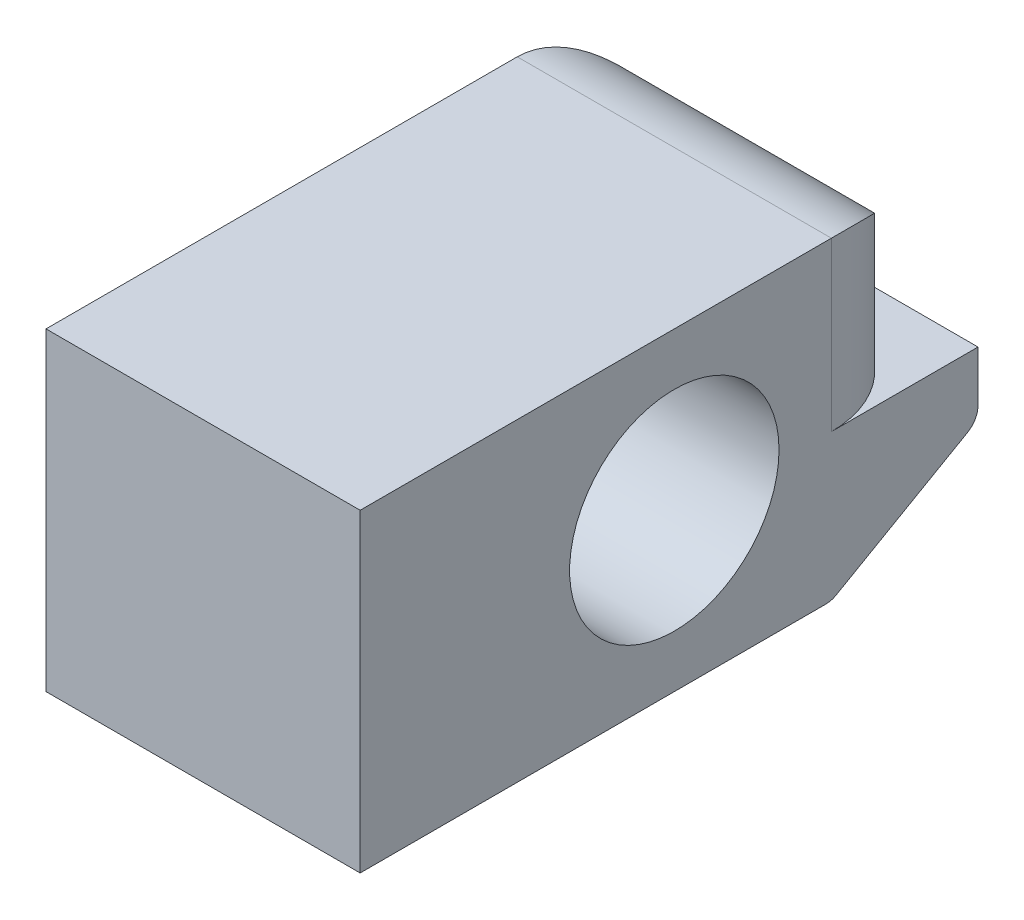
ISO-10303-21;
HEADER;
FILE_DESCRIPTION(('STEP AP214'),'2;1');
FILE_NAME('part.step','',(''),(''),'','','');
FILE_SCHEMA(('AUTOMOTIVE_DESIGN { 1 0 10303 214 1 1 1 1 }'));
ENDSEC;
DATA;
#1=APPLICATION_CONTEXT('core data for automotive mechanical design processes');
#2=APPLICATION_PROTOCOL_DEFINITION('international standard','automotive_design',2000,#1);
#3=PRODUCT_CONTEXT('',#1,'mechanical');
#4=PRODUCT('Part','Part','',(#3));
#5=PRODUCT_RELATED_PRODUCT_CATEGORY('part','',(#4));
#6=PRODUCT_DEFINITION_FORMATION('','',#4);
#7=PRODUCT_DEFINITION_CONTEXT('part definition',#1,'design');
#8=PRODUCT_DEFINITION('design','',#6,#7);
#9=PRODUCT_DEFINITION_SHAPE('','',#8);
#10=(LENGTH_UNIT() NAMED_UNIT(*) SI_UNIT(.MILLI.,.METRE.));
#11=(NAMED_UNIT(*) PLANE_ANGLE_UNIT() SI_UNIT($,.RADIAN.));
#12=(NAMED_UNIT(*) SI_UNIT($,.STERADIAN.) SOLID_ANGLE_UNIT());
#13=UNCERTAINTY_MEASURE_WITH_UNIT(LENGTH_MEASURE(1.E-05),#10,'distance_accuracy_value','');
#14=(GEOMETRIC_REPRESENTATION_CONTEXT(3) GLOBAL_UNCERTAINTY_ASSIGNED_CONTEXT((#13)) GLOBAL_UNIT_ASSIGNED_CONTEXT((#10,
#11,#12)) REPRESENTATION_CONTEXT('',''));
#15=CARTESIAN_POINT('',(0.,0.,0.));
#16=DIRECTION('',(0.,0.,1.));
#17=DIRECTION('',(1.,0.,0.));
#18=AXIS2_PLACEMENT_3D('',#15,#16,#17);
#19=CARTESIAN_POINT('',(3.,3.,0.));
#20=DIRECTION('',(0.,0.,-1.));
#21=DIRECTION('',(-1.,0.,0.));
#22=AXIS2_PLACEMENT_3D('',#19,#20,#21);
#23=PLANE('',#22);
#24=DIRECTION('',(1.,0.,0.));
#25=VECTOR('',#24,1.);
#26=CARTESIAN_POINT('',(3.,0.,0.));
#27=LINE('',#26,#25);
#28=CARTESIAN_POINT('',(0.,0.,0.));
#29=VERTEX_POINT('',#28);
#30=CARTESIAN_POINT('',(3.,0.,0.));
#31=VERTEX_POINT('',#30);
#32=EDGE_CURVE('E172',#29,#31,#27,.T.);
#33=ORIENTED_EDGE('',*,*,#32,.T.);
#34=DIRECTION('',(0.,-1.,0.));
#35=VECTOR('',#34,1.);
#36=CARTESIAN_POINT('',(3.,3.,0.));
#37=LINE('',#36,#35);
#38=CARTESIAN_POINT('',(3.,3.,0.));
#39=VERTEX_POINT('',#38);
#40=EDGE_CURVE('E183',#39,#31,#37,.T.);
#41=ORIENTED_EDGE('',*,*,#40,.F.);
#42=DIRECTION('',(1.,0.,0.));
#43=VECTOR('',#42,1.);
#44=CARTESIAN_POINT('',(3.,3.,0.));
#45=LINE('',#44,#43);
#46=CARTESIAN_POINT('',(0.,3.,0.));
#47=VERTEX_POINT('',#46);
#48=EDGE_CURVE('E165',#47,#39,#45,.T.);
#49=ORIENTED_EDGE('',*,*,#48,.F.);
#50=DIRECTION('',(0.,-1.,0.));
#51=VECTOR('',#50,1.);
#52=CARTESIAN_POINT('',(0.,3.,0.));
#53=LINE('',#52,#51);
#54=EDGE_CURVE('E173',#47,#29,#53,.T.);
#55=ORIENTED_EDGE('',*,*,#54,.T.);
#56=EDGE_LOOP('',(#33,#41,#49,#55));
#57=FACE_BOUND('',#56,.T.);
#58=ADVANCED_FACE('F40',(#57),#23,.F.);
#59=CARTESIAN_POINT('',(3.,3.,-5.5));
#60=DIRECTION('',(-1.,0.,0.));
#61=DIRECTION('',(0.,0.,1.));
#62=AXIS2_PLACEMENT_3D('',#59,#60,#61);
#63=PLANE('',#62);
#64=DIRECTION('',(0.,0.496138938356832,-0.86824314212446));
#65=VECTOR('',#64,1.);
#66=CARTESIAN_POINT('',(3.,0.8,-5.90000000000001));
#67=LINE('',#66,#65);
#68=CARTESIAN_POINT('',(3.,0.0263513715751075,-4.54611490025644));
#69=VERTEX_POINT('',#68);
#70=CARTESIAN_POINT('',(3.,0.742415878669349,-5.79922778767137));
#71=VERTEX_POINT('',#70);
#72=EDGE_CURVE('E215',#69,#71,#67,.T.);
#73=ORIENTED_EDGE('',*,*,#72,.T.);
#74=CARTESIAN_POINT('',(3.,0.916064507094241,-5.7));
#75=DIRECTION('',(-1.,0.,0.));
#76=DIRECTION('',(0.,0.,1.));
#77=AXIS2_PLACEMENT_3D('',#74,#75,#76);
#78=CIRCLE('',#77,0.2);
#79=CARTESIAN_POINT('',(3.,0.916064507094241,-5.9));
#80=VERTEX_POINT('',#79);
#81=EDGE_CURVE('E44',#71,#80,#78,.F.);
#82=ORIENTED_EDGE('',*,*,#81,.T.);
#83=DIRECTION('',(0.,-1.,0.));
#84=VECTOR('',#83,1.);
#85=CARTESIAN_POINT('',(3.,1.4,-5.9));
#86=LINE('',#85,#84);
#87=CARTESIAN_POINT('',(3.,1.4,-5.9));
#88=VERTEX_POINT('',#87);
#89=EDGE_CURVE('E147',#88,#80,#86,.T.);
#90=ORIENTED_EDGE('',*,*,#89,.F.);
#91=DIRECTION('',(0.,0.,-1.));
#92=VECTOR('',#91,1.);
#93=CARTESIAN_POINT('',(2.99999999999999,1.4,0.00200000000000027));
#94=LINE('',#93,#92);
#95=CARTESIAN_POINT('',(3.,1.4,-4.5));
#96=VERTEX_POINT('',#95);
#97=EDGE_CURVE('E139',#96,#88,#94,.T.);
#98=ORIENTED_EDGE('',*,*,#97,.F.);
#99=DIRECTION('',(0.,-1.,0.));
#100=VECTOR('',#99,1.);
#101=CARTESIAN_POINT('',(3.,3.,-4.5));
#102=LINE('',#101,#100);
#103=CARTESIAN_POINT('',(3.,3.,-4.5));
#104=VERTEX_POINT('',#103);
#105=EDGE_CURVE('E122',#96,#104,#102,.F.);
#106=ORIENTED_EDGE('',*,*,#105,.T.);
#107=DIRECTION('',(0.,0.,-1.));
#108=VECTOR('',#107,1.);
#109=CARTESIAN_POINT('',(3.,3.,-5.5));
#110=LINE('',#109,#108);
#111=EDGE_CURVE('E170',#39,#104,#110,.T.);
#112=ORIENTED_EDGE('',*,*,#111,.F.);
#113=ORIENTED_EDGE('',*,*,#40,.T.);
#114=DIRECTION('',(0.,0.,-1.));
#115=VECTOR('',#114,1.);
#116=CARTESIAN_POINT('',(3.,0.,-5.5));
#117=LINE('',#116,#115);
#118=CARTESIAN_POINT('',(3.,0.,-4.44688711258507));
#119=VERTEX_POINT('',#118);
#120=EDGE_CURVE('E180',#31,#119,#117,.T.);
#121=ORIENTED_EDGE('',*,*,#120,.T.);
#122=CARTESIAN_POINT('',(3.,0.2,-4.44688711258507));
#123=DIRECTION('',(-1.,0.,0.));
#124=DIRECTION('',(0.,0.,1.));
#125=AXIS2_PLACEMENT_3D('',#122,#123,#124);
#126=CIRCLE('',#125,0.2);
#127=EDGE_CURVE('E55',#119,#69,#126,.F.);
#128=ORIENTED_EDGE('',*,*,#127,.T.);
#129=EDGE_LOOP('',(#73,#82,#90,#98,#106,#112,#113,#121,#128));
#130=FACE_BOUND('',#129,.T.);
#131=CARTESIAN_POINT('',(3.,1.5,-3.));
#132=DIRECTION('',(1.,0.,0.));
#133=DIRECTION('',(0.,0.,-1.));
#134=AXIS2_PLACEMENT_3D('',#131,#132,#133);
#135=CIRCLE('',#134,1.);
#136=CARTESIAN_POINT('',(3.,1.5,-4.));
#137=VERTEX_POINT('',#136);
#138=EDGE_CURVE('E159',#137,#137,#135,.T.);
#139=ORIENTED_EDGE('',*,*,#138,.F.);
#140=EDGE_LOOP('',(#139));
#141=FACE_BOUND('',#140,.T.);
#142=ADVANCED_FACE('F150',(#130,#141),#63,.F.);
#143=CARTESIAN_POINT('',(0.,3.,-5.50000000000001));
#144=DIRECTION('',(0.,0.,1.));
#145=DIRECTION('',(1.,0.,0.));
#146=AXIS2_PLACEMENT_3D('',#143,#144,#145);
#147=PLANE('',#146);
#148=DIRECTION('',(0.,-1.,0.));
#149=VECTOR('',#148,1.);
#150=CARTESIAN_POINT('',(2.,3.,-5.5));
#151=LINE('',#150,#149);
#152=CARTESIAN_POINT('',(2.,2.,-5.5));
#153=VERTEX_POINT('',#152);
#154=CARTESIAN_POINT('',(2.,1.4,-5.5));
#155=VERTEX_POINT('',#154);
#156=EDGE_CURVE('E134',#153,#155,#151,.T.);
#157=ORIENTED_EDGE('',*,*,#156,.T.);
#158=DIRECTION('',(1.,0.,0.));
#159=VECTOR('',#158,1.);
#160=CARTESIAN_POINT('',(0.,1.4,-5.50000000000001));
#161=LINE('',#160,#159);
#162=CARTESIAN_POINT('',(1.,1.4,-5.5));
#163=VERTEX_POINT('',#162);
#164=EDGE_CURVE('E145',#163,#155,#161,.T.);
#165=ORIENTED_EDGE('',*,*,#164,.F.);
#166=DIRECTION('',(0.,-1.,0.));
#167=VECTOR('',#166,1.);
#168=CARTESIAN_POINT('',(1.,3.,-5.5));
#169=LINE('',#168,#167);
#170=CARTESIAN_POINT('',(1.,2.,-5.5));
#171=VERTEX_POINT('',#170);
#172=EDGE_CURVE('E190',#163,#171,#169,.F.);
#173=ORIENTED_EDGE('',*,*,#172,.T.);
#174=DIRECTION('',(-1.,0.,0.));
#175=VECTOR('',#174,1.);
#176=CARTESIAN_POINT('',(0.,2.,-5.50000000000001));
#177=LINE('',#176,#175);
#178=EDGE_CURVE('E186',#171,#153,#177,.F.);
#179=ORIENTED_EDGE('',*,*,#178,.T.);
#180=EDGE_LOOP('',(#157,#165,#173,#179));
#181=FACE_BOUND('',#180,.T.);
#182=ADVANCED_FACE('F246',(#181),#147,.F.);
#183=CARTESIAN_POINT('',(0.,3.,0.));
#184=DIRECTION('',(1.,0.,0.));
#185=DIRECTION('',(0.,0.,-1.));
#186=AXIS2_PLACEMENT_3D('',#183,#184,#185);
#187=PLANE('',#186);
#188=DIRECTION('',(0.,1.,0.));
#189=VECTOR('',#188,1.);
#190=CARTESIAN_POINT('',(0.,0.8,-5.9));
#191=LINE('',#190,#189);
#192=CARTESIAN_POINT('',(0.,0.916064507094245,-5.9));
#193=VERTEX_POINT('',#192);
#194=CARTESIAN_POINT('',(0.,1.4,-5.9));
#195=VERTEX_POINT('',#194);
#196=EDGE_CURVE('E153',#193,#195,#191,.T.);
#197=ORIENTED_EDGE('',*,*,#196,.F.);
#198=CARTESIAN_POINT('',(0.,0.916064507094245,-5.70000000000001));
#199=DIRECTION('',(1.,0.,0.));
#200=DIRECTION('',(0.,0.,-1.));
#201=AXIS2_PLACEMENT_3D('',#198,#199,#200);
#202=CIRCLE('',#201,0.2);
#203=CARTESIAN_POINT('',(0.,0.742415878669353,-5.79922778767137));
#204=VERTEX_POINT('',#203);
#205=EDGE_CURVE('E207',#193,#204,#202,.F.);
#206=ORIENTED_EDGE('',*,*,#205,.T.);
#207=DIRECTION('',(0.,-0.496138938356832,0.86824314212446));
#208=VECTOR('',#207,1.);
#209=CARTESIAN_POINT('',(0.,0.8,-5.9));
#210=LINE('',#209,#208);
#211=CARTESIAN_POINT('',(0.,0.0263513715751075,-4.54611490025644));
#212=VERTEX_POINT('',#211);
#213=EDGE_CURVE('E144',#204,#212,#210,.T.);
#214=ORIENTED_EDGE('',*,*,#213,.T.);
#215=CARTESIAN_POINT('',(0.,0.2,-4.44688711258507));
#216=DIRECTION('',(1.,0.,0.));
#217=DIRECTION('',(0.,0.,-1.));
#218=AXIS2_PLACEMENT_3D('',#215,#216,#217);
#219=CIRCLE('',#218,0.2);
#220=CARTESIAN_POINT('',(0.,0.,-4.44688711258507));
#221=VERTEX_POINT('',#220);
#222=EDGE_CURVE('E203',#212,#221,#219,.F.);
#223=ORIENTED_EDGE('',*,*,#222,.T.);
#224=DIRECTION('',(0.,0.,1.));
#225=VECTOR('',#224,1.);
#226=CARTESIAN_POINT('',(0.,0.,0.));
#227=LINE('',#226,#225);
#228=EDGE_CURVE('E166',#221,#29,#227,.T.);
#229=ORIENTED_EDGE('',*,*,#228,.T.);
#230=ORIENTED_EDGE('',*,*,#54,.F.);
#231=DIRECTION('',(0.,0.,1.));
#232=VECTOR('',#231,1.);
#233=CARTESIAN_POINT('',(0.,3.,0.));
#234=LINE('',#233,#232);
#235=CARTESIAN_POINT('',(0.,3.,-4.5));
#236=VERTEX_POINT('',#235);
#237=EDGE_CURVE('E171',#236,#47,#234,.T.);
#238=ORIENTED_EDGE('',*,*,#237,.F.);
#239=DIRECTION('',(0.,-1.,0.));
#240=VECTOR('',#239,1.);
#241=CARTESIAN_POINT('',(0.,3.,-4.5));
#242=LINE('',#241,#240);
#243=CARTESIAN_POINT('',(0.,1.4,-4.5));
#244=VERTEX_POINT('',#243);
#245=EDGE_CURVE('E191',#236,#244,#242,.T.);
#246=ORIENTED_EDGE('',*,*,#245,.T.);
#247=DIRECTION('',(0.,0.,-1.));
#248=VECTOR('',#247,1.);
#249=CARTESIAN_POINT('',(0.,1.4,0.00199999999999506));
#250=LINE('',#249,#248);
#251=EDGE_CURVE('E152',#244,#195,#250,.T.);
#252=ORIENTED_EDGE('',*,*,#251,.T.);
#253=EDGE_LOOP('',(#197,#206,#214,#223,#229,#230,#238,#246,#252));
#254=FACE_BOUND('',#253,.T.);
#255=CARTESIAN_POINT('',(0.,1.5,-3.));
#256=DIRECTION('',(1.,0.,0.));
#257=DIRECTION('',(0.,0.,-1.));
#258=AXIS2_PLACEMENT_3D('',#255,#256,#257);
#259=CIRCLE('',#258,1.);
#260=CARTESIAN_POINT('',(0.,1.5,-4.));
#261=VERTEX_POINT('',#260);
#262=EDGE_CURVE('E161',#261,#261,#259,.T.);
#263=ORIENTED_EDGE('',*,*,#262,.T.);
#264=EDGE_LOOP('',(#263));
#265=FACE_BOUND('',#264,.T.);
#266=ADVANCED_FACE('F225',(#254,#265),#187,.F.);
#267=CARTESIAN_POINT('',(0.,3.,0.));
#268=DIRECTION('',(0.,-1.,0.));
#269=DIRECTION('',(0.,0.,-1.));
#270=AXIS2_PLACEMENT_3D('',#267,#268,#269);
#271=PLANE('',#270);
#272=ORIENTED_EDGE('',*,*,#111,.T.);
#273=DIRECTION('',(-1.,0.,0.));
#274=VECTOR('',#273,1.);
#275=CARTESIAN_POINT('',(0.,3.,-4.5));
#276=LINE('',#275,#274);
#277=EDGE_CURVE('E132',#104,#236,#276,.T.);
#278=ORIENTED_EDGE('',*,*,#277,.T.);
#279=ORIENTED_EDGE('',*,*,#237,.T.);
#280=ORIENTED_EDGE('',*,*,#48,.T.);
#281=EDGE_LOOP('',(#272,#278,#279,#280));
#282=FACE_BOUND('',#281,.T.);
#283=ADVANCED_FACE('F239',(#282),#271,.F.);
#284=CARTESIAN_POINT('',(0.,0.,0.));
#285=DIRECTION('',(0.,-1.,0.));
#286=DIRECTION('',(0.,0.,-1.));
#287=AXIS2_PLACEMENT_3D('',#284,#285,#286);
#288=PLANE('',#287);
#289=ORIENTED_EDGE('',*,*,#228,.F.);
#290=DIRECTION('',(1.,0.,0.));
#291=VECTOR('',#290,1.);
#292=CARTESIAN_POINT('',(0.,0.,-4.44688711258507));
#293=LINE('',#292,#291);
#294=EDGE_CURVE('E11',#221,#119,#293,.T.);
#295=ORIENTED_EDGE('',*,*,#294,.T.);
#296=ORIENTED_EDGE('',*,*,#120,.F.);
#297=ORIENTED_EDGE('',*,*,#32,.F.);
#298=EDGE_LOOP('',(#289,#295,#296,#297));
#299=FACE_BOUND('',#298,.T.);
#300=ADVANCED_FACE('F268',(#299),#288,.T.);
#301=CARTESIAN_POINT('',(1.,3.,-4.5));
#302=DIRECTION('',(0.,-1.,0.));
#303=DIRECTION('',(0.,0.,-1.));
#304=AXIS2_PLACEMENT_3D('',#301,#302,#303);
#305=CYLINDRICAL_SURFACE('',#304,1.);
#306=CARTESIAN_POINT('',(1.,1.4,-4.5));
#307=DIRECTION('',(0.,1.,0.));
#308=DIRECTION('',(-1.,0.,0.));
#309=AXIS2_PLACEMENT_3D('',#306,#307,#308);
#310=CIRCLE('',#309,1.);
#311=EDGE_CURVE('E141',#163,#244,#310,.T.);
#312=ORIENTED_EDGE('',*,*,#311,.T.);
#313=ORIENTED_EDGE('',*,*,#245,.F.);
#314=CARTESIAN_POINT('',(1.,2.,-4.5));
#315=DIRECTION('',(-0.707106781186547,-0.707106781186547,0.));
#316=DIRECTION('',(0.707106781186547,-0.707106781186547,0.));
#317=AXIS2_PLACEMENT_3D('',#314,#315,#316);
#318=ELLIPSE('',#317,1.41421356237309,1.);
#319=EDGE_CURVE('E178',#171,#236,#318,.F.);
#320=ORIENTED_EDGE('',*,*,#319,.F.);
#321=ORIENTED_EDGE('',*,*,#172,.F.);
#322=EDGE_LOOP('',(#312,#313,#320,#321));
#323=FACE_BOUND('',#322,.T.);
#324=ADVANCED_FACE('F231',(#323),#305,.T.);
#325=CARTESIAN_POINT('',(0.,2.,-4.5));
#326=DIRECTION('',(-1.,0.,0.));
#327=DIRECTION('',(0.,0.,1.));
#328=AXIS2_PLACEMENT_3D('',#325,#326,#327);
#329=CYLINDRICAL_SURFACE('',#328,1.);
#330=ORIENTED_EDGE('',*,*,#319,.T.);
#331=ORIENTED_EDGE('',*,*,#277,.F.);
#332=CARTESIAN_POINT('',(2.,2.,-4.5));
#333=DIRECTION('',(-0.707106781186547,0.707106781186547,0.));
#334=DIRECTION('',(-0.707106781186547,-0.707106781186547,0.));
#335=AXIS2_PLACEMENT_3D('',#332,#333,#334);
#336=ELLIPSE('',#335,1.41421356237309,1.);
#337=EDGE_CURVE('E126',#153,#104,#336,.F.);
#338=ORIENTED_EDGE('',*,*,#337,.F.);
#339=ORIENTED_EDGE('',*,*,#178,.F.);
#340=EDGE_LOOP('',(#330,#331,#338,#339));
#341=FACE_BOUND('',#340,.T.);
#342=ADVANCED_FACE('F243',(#341),#329,.T.);
#343=CARTESIAN_POINT('',(2.,3.,-4.5));
#344=DIRECTION('',(0.,-1.,0.));
#345=DIRECTION('',(0.,0.,-1.));
#346=AXIS2_PLACEMENT_3D('',#343,#344,#345);
#347=CYLINDRICAL_SURFACE('',#346,1.);
#348=CARTESIAN_POINT('',(2.,1.4,-4.5));
#349=DIRECTION('',(0.,1.,0.));
#350=DIRECTION('',(-1.,0.,0.));
#351=AXIS2_PLACEMENT_3D('',#348,#349,#350);
#352=CIRCLE('',#351,1.);
#353=EDGE_CURVE('E123',#96,#155,#352,.T.);
#354=ORIENTED_EDGE('',*,*,#353,.T.);
#355=ORIENTED_EDGE('',*,*,#156,.F.);
#356=ORIENTED_EDGE('',*,*,#337,.T.);
#357=ORIENTED_EDGE('',*,*,#105,.F.);
#358=EDGE_LOOP('',(#354,#355,#356,#357));
#359=FACE_BOUND('',#358,.T.);
#360=ADVANCED_FACE('F124',(#359),#347,.T.);
#361=CARTESIAN_POINT('',(-1.2E-05,1.5,-3.));
#362=DIRECTION('',(1.,0.,0.));
#363=DIRECTION('',(0.,0.,-1.));
#364=AXIS2_PLACEMENT_3D('',#361,#362,#363);
#365=CYLINDRICAL_SURFACE('',#364,1.);
#366=CARTESIAN_POINT('',(3.,1.5,-4.));
#367=CARTESIAN_POINT('',(2.96875,1.5,-4.));
#368=CARTESIAN_POINT('',(2.9375,1.5,-4.));
#369=CARTESIAN_POINT('',(2.875,1.5,-4.));
#370=CARTESIAN_POINT('',(2.84375,1.5,-4.));
#371=CARTESIAN_POINT('',(2.78125,1.5,-4.));
#372=CARTESIAN_POINT('',(2.75,1.5,-4.));
#373=CARTESIAN_POINT('',(2.6875,1.5,-4.));
#374=CARTESIAN_POINT('',(2.65625,1.5,-4.));
#375=CARTESIAN_POINT('',(2.59375,1.5,-4.));
#376=CARTESIAN_POINT('',(2.5625,1.5,-4.));
#377=CARTESIAN_POINT('',(2.5,1.5,-4.));
#378=CARTESIAN_POINT('',(2.46875,1.5,-4.));
#379=CARTESIAN_POINT('',(2.40625,1.5,-4.));
#380=CARTESIAN_POINT('',(2.375,1.5,-4.));
#381=CARTESIAN_POINT('',(2.3125,1.5,-4.));
#382=CARTESIAN_POINT('',(2.28125,1.5,-4.));
#383=CARTESIAN_POINT('',(2.21875,1.5,-4.));
#384=CARTESIAN_POINT('',(2.1875,1.5,-4.));
#385=CARTESIAN_POINT('',(2.125,1.5,-4.));
#386=CARTESIAN_POINT('',(2.09375,1.5,-4.));
#387=CARTESIAN_POINT('',(2.03125,1.5,-4.));
#388=CARTESIAN_POINT('',(2.,1.5,-4.));
#389=CARTESIAN_POINT('',(1.9375,1.5,-4.));
#390=CARTESIAN_POINT('',(1.90625,1.5,-4.));
#391=CARTESIAN_POINT('',(1.84375,1.5,-4.));
#392=CARTESIAN_POINT('',(1.8125,1.5,-4.));
#393=CARTESIAN_POINT('',(1.75,1.5,-4.));
#394=CARTESIAN_POINT('',(1.71875,1.5,-4.));
#395=CARTESIAN_POINT('',(1.65625,1.5,-4.));
#396=CARTESIAN_POINT('',(1.625,1.5,-4.));
#397=CARTESIAN_POINT('',(1.5625,1.5,-4.));
#398=CARTESIAN_POINT('',(1.53125,1.5,-4.));
#399=CARTESIAN_POINT('',(1.46875,1.5,-4.));
#400=CARTESIAN_POINT('',(1.4375,1.5,-4.));
#401=CARTESIAN_POINT('',(1.375,1.5,-4.));
#402=CARTESIAN_POINT('',(1.34375,1.5,-4.));
#403=CARTESIAN_POINT('',(1.28125,1.5,-4.));
#404=CARTESIAN_POINT('',(1.25,1.5,-4.));
#405=CARTESIAN_POINT('',(1.1875,1.5,-4.));
#406=CARTESIAN_POINT('',(1.15625,1.5,-4.));
#407=CARTESIAN_POINT('',(1.09375,1.5,-4.));
#408=CARTESIAN_POINT('',(1.0625,1.5,-4.));
#409=CARTESIAN_POINT('',(1.,1.5,-4.));
#410=CARTESIAN_POINT('',(0.96875,1.5,-4.));
#411=CARTESIAN_POINT('',(0.90625,1.5,-4.));
#412=CARTESIAN_POINT('',(0.875,1.5,-4.));
#413=CARTESIAN_POINT('',(0.8125,1.5,-4.));
#414=CARTESIAN_POINT('',(0.78125,1.5,-4.));
#415=CARTESIAN_POINT('',(0.71875,1.5,-4.));
#416=CARTESIAN_POINT('',(0.6875,1.5,-4.));
#417=CARTESIAN_POINT('',(0.625,1.5,-4.));
#418=CARTESIAN_POINT('',(0.59375,1.5,-4.));
#419=CARTESIAN_POINT('',(0.53125,1.5,-4.));
#420=CARTESIAN_POINT('',(0.5,1.5,-4.));
#421=CARTESIAN_POINT('',(0.4375,1.5,-4.));
#422=CARTESIAN_POINT('',(0.40625,1.5,-4.));
#423=CARTESIAN_POINT('',(0.34375,1.5,-4.));
#424=CARTESIAN_POINT('',(0.3125,1.5,-4.));
#425=CARTESIAN_POINT('',(0.25,1.5,-4.));
#426=CARTESIAN_POINT('',(0.21875,1.5,-4.));
#427=CARTESIAN_POINT('',(0.15625,1.5,-4.));
#428=CARTESIAN_POINT('',(0.125,1.5,-4.));
#429=CARTESIAN_POINT('',(0.0625000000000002,1.5,-4.));
#430=CARTESIAN_POINT('',(0.0312500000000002,1.5,-4.));
#431=CARTESIAN_POINT('',(0.,1.5,-4.));
#432=B_SPLINE_CURVE_WITH_KNOTS('',3,(#366,#367,#368,#369,#370,#371,#372,#373,#374,#375,#376,
#377,#378,#379,#380,#381,#382,#383,#384,#385,#386,#387,#388,#389,#390,#391,#392,#393,#394,#395,
#396,#397,#398,#399,#400,#401,#402,#403,#404,#405,#406,#407,#408,#409,#410,#411,#412,#413,#414,
#415,#416,#417,#418,#419,#420,#421,#422,#423,#424,#425,#426,#427,#428,#429,#430,#431),
.UNSPECIFIED.,.F.,.F.,(4,2,2,2,2,2,2,2,2,2,2,2,2,2,2,2,2,2,2,2,2,2,2,2,2,2,2,2,2,2,2,2,4),(0.,
0.0937500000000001,0.1875,0.28125,0.375,0.46875,0.5625,0.65625,0.75,0.84375,0.9375,1.03125,
1.125,1.21875,1.3125,1.40625,1.5,1.59375,1.6875,1.78125,1.875,1.96875,2.0625,2.15625,2.25,
2.34375,2.4375,2.53125,2.625,2.71875,2.8125,2.90625,3.),.UNSPECIFIED.);
#433=EDGE_CURVE('BSEAM266',#137,#261,#432,.T.);
#434=ORIENTED_EDGE('',*,*,#138,.T.);
#435=ORIENTED_EDGE('',*,*,#262,.F.);
#436=ORIENTED_EDGE('',*,*,#433,.T.);
#437=ORIENTED_EDGE('',*,*,#433,.F.);
#438=EDGE_LOOP('',(#434,#436,#435,#437));
#439=FACE_BOUND('',#438,.T.);
#440=ADVANCED_FACE('F266',(#439),#365,.F.);
#441=CARTESIAN_POINT('',(0.,0.,-5.9));
#442=DIRECTION('',(0.,0.,-1.));
#443=DIRECTION('',(-1.,0.,0.));
#444=AXIS2_PLACEMENT_3D('',#441,#442,#443);
#445=PLANE('',#444);
#446=ORIENTED_EDGE('',*,*,#89,.T.);
#447=DIRECTION('',(-1.,0.,0.));
#448=VECTOR('',#447,1.);
#449=CARTESIAN_POINT('',(0.,0.916064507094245,-5.9));
#450=LINE('',#449,#448);
#451=EDGE_CURVE('E196',#80,#193,#450,.T.);
#452=ORIENTED_EDGE('',*,*,#451,.T.);
#453=ORIENTED_EDGE('',*,*,#196,.T.);
#454=DIRECTION('',(1.,0.,0.));
#455=VECTOR('',#454,1.);
#456=CARTESIAN_POINT('',(0.,1.4,-5.9));
#457=LINE('',#456,#455);
#458=EDGE_CURVE('E151',#195,#88,#457,.T.);
#459=ORIENTED_EDGE('',*,*,#458,.T.);
#460=EDGE_LOOP('',(#446,#452,#453,#459));
#461=FACE_BOUND('',#460,.T.);
#462=ADVANCED_FACE('F216',(#461),#445,.T.);
#463=CARTESIAN_POINT('',(0.,1.4,0.00199999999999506));
#464=DIRECTION('',(0.,1.,0.));
#465=DIRECTION('',(-1.,0.,0.));
#466=AXIS2_PLACEMENT_3D('',#463,#464,#465);
#467=PLANE('',#466);
#468=ORIENTED_EDGE('',*,*,#311,.F.);
#469=ORIENTED_EDGE('',*,*,#164,.T.);
#470=ORIENTED_EDGE('',*,*,#353,.F.);
#471=ORIENTED_EDGE('',*,*,#97,.T.);
#472=ORIENTED_EDGE('',*,*,#458,.F.);
#473=ORIENTED_EDGE('',*,*,#251,.F.);
#474=EDGE_LOOP('',(#468,#469,#470,#471,#472,#473));
#475=FACE_BOUND('',#474,.T.);
#476=ADVANCED_FACE('F137',(#475),#467,.T.);
#477=CARTESIAN_POINT('',(-1.61245154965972,0.8,-5.9));
#478=DIRECTION('',(0.,-0.86824314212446,-0.496138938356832));
#479=DIRECTION('',(0.,0.496138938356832,-0.86824314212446));
#480=AXIS2_PLACEMENT_3D('',#477,#478,#479);
#481=PLANE('',#480);
#482=ORIENTED_EDGE('',*,*,#213,.F.);
#483=DIRECTION('',(-1.,0.,0.));
#484=VECTOR('',#483,1.);
#485=CARTESIAN_POINT('',(-1.61245154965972,0.742415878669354,-5.79922778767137));
#486=LINE('',#485,#484);
#487=EDGE_CURVE('E56',#204,#71,#486,.F.);
#488=ORIENTED_EDGE('',*,*,#487,.T.);
#489=ORIENTED_EDGE('',*,*,#72,.F.);
#490=DIRECTION('',(1.,0.,0.));
#491=VECTOR('',#490,1.);
#492=CARTESIAN_POINT('',(-1.61245154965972,0.0263513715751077,-4.54611490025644));
#493=LINE('',#492,#491);
#494=EDGE_CURVE('E206',#69,#212,#493,.F.);
#495=ORIENTED_EDGE('',*,*,#494,.T.);
#496=EDGE_LOOP('',(#482,#488,#489,#495));
#497=FACE_BOUND('',#496,.T.);
#498=ADVANCED_FACE('F224',(#497),#481,.T.);
#499=CARTESIAN_POINT('',(0.,0.916064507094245,-5.70000000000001));
#500=DIRECTION('',(-1.,0.,0.));
#501=DIRECTION('',(0.,0.,1.));
#502=AXIS2_PLACEMENT_3D('',#499,#500,#501);
#503=CYLINDRICAL_SURFACE('',#502,0.2);
#504=ORIENTED_EDGE('',*,*,#81,.F.);
#505=ORIENTED_EDGE('',*,*,#487,.F.);
#506=ORIENTED_EDGE('',*,*,#205,.F.);
#507=ORIENTED_EDGE('',*,*,#451,.F.);
#508=EDGE_LOOP('',(#504,#505,#506,#507));
#509=FACE_BOUND('',#508,.T.);
#510=ADVANCED_FACE('F218',(#509),#503,.T.);
#511=CARTESIAN_POINT('',(0.,0.2,-4.44688711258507));
#512=DIRECTION('',(1.,0.,0.));
#513=DIRECTION('',(0.,0.,-1.));
#514=AXIS2_PLACEMENT_3D('',#511,#512,#513);
#515=CYLINDRICAL_SURFACE('',#514,0.2);
#516=ORIENTED_EDGE('',*,*,#222,.F.);
#517=ORIENTED_EDGE('',*,*,#494,.F.);
#518=ORIENTED_EDGE('',*,*,#127,.F.);
#519=ORIENTED_EDGE('',*,*,#294,.F.);
#520=EDGE_LOOP('',(#516,#517,#518,#519));
#521=FACE_BOUND('',#520,.T.);
#522=ADVANCED_FACE('F39',(#521),#515,.T.);
#523=CLOSED_SHELL('',(#58,#142,#182,#266,#283,#300,#324,#342,#360,#440,#462,#476,#498,#510,#522));
#524=MANIFOLD_SOLID_BREP('B2',#523);
#525=ADVANCED_BREP_SHAPE_REPRESENTATION('',(#18,#524),#14);
#526=SHAPE_DEFINITION_REPRESENTATION(#9,#525);
ENDSEC;
END-ISO-10303-21;
